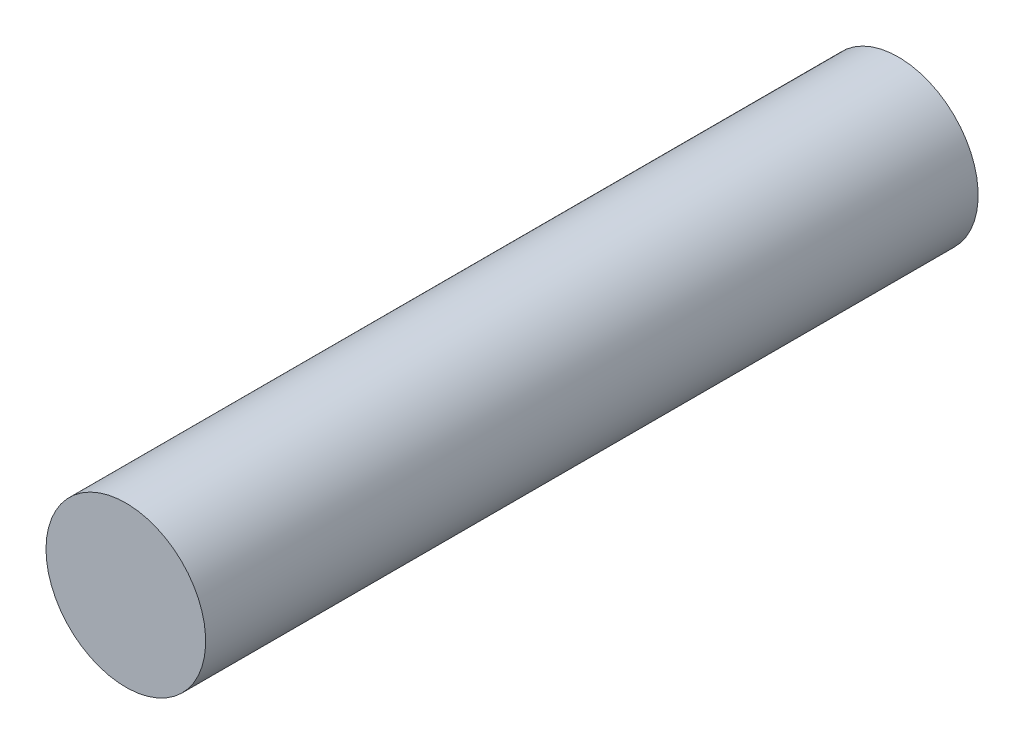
ISO-10303-21;
HEADER;
FILE_DESCRIPTION(('STEP AP214'),'2;1');
FILE_NAME('part.step','',(''),(''),'','','');
FILE_SCHEMA(('AUTOMOTIVE_DESIGN { 1 0 10303 214 1 1 1 1 }'));
ENDSEC;
DATA;
#1=APPLICATION_CONTEXT('core data for automotive mechanical design processes');
#2=APPLICATION_PROTOCOL_DEFINITION('international standard','automotive_design',2000,#1);
#3=PRODUCT_CONTEXT('',#1,'mechanical');
#4=PRODUCT('Part','Part','',(#3));
#5=PRODUCT_RELATED_PRODUCT_CATEGORY('part','',(#4));
#6=PRODUCT_DEFINITION_FORMATION('','',#4);
#7=PRODUCT_DEFINITION_CONTEXT('part definition',#1,'design');
#8=PRODUCT_DEFINITION('design','',#6,#7);
#9=PRODUCT_DEFINITION_SHAPE('','',#8);
#10=(LENGTH_UNIT() NAMED_UNIT(*) SI_UNIT(.MILLI.,.METRE.));
#11=(NAMED_UNIT(*) PLANE_ANGLE_UNIT() SI_UNIT($,.RADIAN.));
#12=(NAMED_UNIT(*) SI_UNIT($,.STERADIAN.) SOLID_ANGLE_UNIT());
#13=UNCERTAINTY_MEASURE_WITH_UNIT(LENGTH_MEASURE(1.E-05),#10,'distance_accuracy_value','');
#14=(GEOMETRIC_REPRESENTATION_CONTEXT(3) GLOBAL_UNCERTAINTY_ASSIGNED_CONTEXT((#13)) GLOBAL_UNIT_ASSIGNED_CONTEXT((#10,
#11,#12)) REPRESENTATION_CONTEXT('',''));
#15=CARTESIAN_POINT('',(0.,0.,0.));
#16=DIRECTION('',(0.,0.,1.));
#17=DIRECTION('',(1.,0.,0.));
#18=AXIS2_PLACEMENT_3D('',#15,#16,#17);
#19=CARTESIAN_POINT('',(0.,0.,38.1));
#20=DIRECTION('',(0.,0.,-1.));
#21=DIRECTION('',(-1.,0.,0.));
#22=AXIS2_PLACEMENT_3D('',#19,#20,#21);
#23=CYLINDRICAL_SURFACE('',#22,3.937);
#24=CARTESIAN_POINT('',(0.,0.,38.1));
#25=DIRECTION('',(0.,0.,1.));
#26=DIRECTION('',(1.,0.,0.));
#27=AXIS2_PLACEMENT_3D('',#24,#25,#26);
#28=CIRCLE('',#27,3.937);
#29=CARTESIAN_POINT('',(-3.937,0.,38.1));
#30=VERTEX_POINT('',#29);
#31=EDGE_CURVE('E10',#30,#30,#28,.T.);
#32=CARTESIAN_POINT('',(0.,0.,0.));
#33=DIRECTION('',(0.,0.,1.));
#34=DIRECTION('',(1.,0.,0.));
#35=AXIS2_PLACEMENT_3D('',#32,#33,#34);
#36=CIRCLE('',#35,3.937);
#37=CARTESIAN_POINT('',(-3.937,0.,0.));
#38=VERTEX_POINT('',#37);
#39=EDGE_CURVE('E46',#38,#38,#36,.T.);
#40=CARTESIAN_POINT('',(-3.937,0.,38.1));
#41=CARTESIAN_POINT('',(-3.937,0.,37.703125));
#42=CARTESIAN_POINT('',(-3.937,0.,37.30625));
#43=CARTESIAN_POINT('',(-3.937,0.,36.5125));
#44=CARTESIAN_POINT('',(-3.937,0.,36.115625));
#45=CARTESIAN_POINT('',(-3.937,0.,35.321875));
#46=CARTESIAN_POINT('',(-3.937,0.,34.925));
#47=CARTESIAN_POINT('',(-3.937,0.,34.13125));
#48=CARTESIAN_POINT('',(-3.937,0.,33.734375));
#49=CARTESIAN_POINT('',(-3.937,0.,32.940625));
#50=CARTESIAN_POINT('',(-3.937,0.,32.54375));
#51=CARTESIAN_POINT('',(-3.937,0.,31.75));
#52=CARTESIAN_POINT('',(-3.937,0.,31.353125));
#53=CARTESIAN_POINT('',(-3.937,0.,30.559375));
#54=CARTESIAN_POINT('',(-3.937,0.,30.1625));
#55=CARTESIAN_POINT('',(-3.937,0.,29.36875));
#56=CARTESIAN_POINT('',(-3.937,0.,28.971875));
#57=CARTESIAN_POINT('',(-3.937,0.,28.178125));
#58=CARTESIAN_POINT('',(-3.937,0.,27.78125));
#59=CARTESIAN_POINT('',(-3.937,0.,26.9875));
#60=CARTESIAN_POINT('',(-3.937,0.,26.590625));
#61=CARTESIAN_POINT('',(-3.937,0.,25.796875));
#62=CARTESIAN_POINT('',(-3.937,0.,25.4));
#63=CARTESIAN_POINT('',(-3.937,0.,24.60625));
#64=CARTESIAN_POINT('',(-3.937,0.,24.209375));
#65=CARTESIAN_POINT('',(-3.937,0.,23.415625));
#66=CARTESIAN_POINT('',(-3.937,0.,23.01875));
#67=CARTESIAN_POINT('',(-3.937,0.,22.225));
#68=CARTESIAN_POINT('',(-3.937,0.,21.828125));
#69=CARTESIAN_POINT('',(-3.937,0.,21.034375));
#70=CARTESIAN_POINT('',(-3.937,0.,20.6375));
#71=CARTESIAN_POINT('',(-3.937,0.,19.84375));
#72=CARTESIAN_POINT('',(-3.937,0.,19.446875));
#73=CARTESIAN_POINT('',(-3.937,0.,18.653125));
#74=CARTESIAN_POINT('',(-3.937,0.,18.25625));
#75=CARTESIAN_POINT('',(-3.937,0.,17.4625));
#76=CARTESIAN_POINT('',(-3.937,0.,17.065625));
#77=CARTESIAN_POINT('',(-3.937,0.,16.271875));
#78=CARTESIAN_POINT('',(-3.937,0.,15.875));
#79=CARTESIAN_POINT('',(-3.937,0.,15.08125));
#80=CARTESIAN_POINT('',(-3.937,0.,14.684375));
#81=CARTESIAN_POINT('',(-3.937,0.,13.890625));
#82=CARTESIAN_POINT('',(-3.937,0.,13.49375));
#83=CARTESIAN_POINT('',(-3.937,0.,12.7));
#84=CARTESIAN_POINT('',(-3.937,0.,12.303125));
#85=CARTESIAN_POINT('',(-3.937,0.,11.509375));
#86=CARTESIAN_POINT('',(-3.937,0.,11.1125));
#87=CARTESIAN_POINT('',(-3.937,0.,10.31875));
#88=CARTESIAN_POINT('',(-3.937,0.,9.92187499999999));
#89=CARTESIAN_POINT('',(-3.937,0.,9.128125));
#90=CARTESIAN_POINT('',(-3.937,0.,8.73124999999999));
#91=CARTESIAN_POINT('',(-3.937,0.,7.93749999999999));
#92=CARTESIAN_POINT('',(-3.937,0.,7.54062499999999));
#93=CARTESIAN_POINT('',(-3.937,0.,6.746875));
#94=CARTESIAN_POINT('',(-3.937,0.,6.35));
#95=CARTESIAN_POINT('',(-3.937,0.,5.55625));
#96=CARTESIAN_POINT('',(-3.937,0.,5.159375));
#97=CARTESIAN_POINT('',(-3.937,0.,4.365625));
#98=CARTESIAN_POINT('',(-3.937,0.,3.96875));
#99=CARTESIAN_POINT('',(-3.937,0.,3.175));
#100=CARTESIAN_POINT('',(-3.937,0.,2.778125));
#101=CARTESIAN_POINT('',(-3.937,0.,1.984375));
#102=CARTESIAN_POINT('',(-3.937,0.,1.5875));
#103=CARTESIAN_POINT('',(-3.937,0.,0.79375));
#104=CARTESIAN_POINT('',(-3.937,0.,0.396875));
#105=CARTESIAN_POINT('',(-3.937,0.,0.));
#106=B_SPLINE_CURVE_WITH_KNOTS('',3,(#40,#41,#42,#43,#44,#45,#46,#47,#48,#49,#50,#51,#52,#53,
#54,#55,#56,#57,#58,#59,#60,#61,#62,#63,#64,#65,#66,#67,#68,#69,#70,#71,#72,#73,#74,#75,#76,#77,
#78,#79,#80,#81,#82,#83,#84,#85,#86,#87,#88,#89,#90,#91,#92,#93,#94,#95,#96,#97,#98,#99,#100,
#101,#102,#103,#104,#105),.UNSPECIFIED.,.F.,.F.,(4,2,2,2,2,2,2,2,2,2,2,2,2,2,2,2,2,2,2,2,2,2,2,
2,2,2,2,2,2,2,2,2,4),(0.,1.190625,2.38125,3.571875,4.7625,5.953125,7.14375,8.334375,
9.52500000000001,10.715625,11.90625,13.096875,14.2875,15.478125,16.66875,17.859375,19.05,
20.240625,21.43125,22.621875,23.8125,25.003125,26.19375,27.384375,28.575,29.765625,30.95625,
32.146875,33.3375,34.528125,35.71875,36.909375,38.1),.UNSPECIFIED.);
#107=EDGE_CURVE('BSEAM43',#30,#38,#106,.T.);
#108=ORIENTED_EDGE('',*,*,#31,.F.);
#109=ORIENTED_EDGE('',*,*,#39,.T.);
#110=ORIENTED_EDGE('',*,*,#107,.T.);
#111=ORIENTED_EDGE('',*,*,#107,.F.);
#112=EDGE_LOOP('',(#108,#110,#109,#111));
#113=FACE_BOUND('',#112,.T.);
#114=ADVANCED_FACE('F43',(#113),#23,.T.);
#115=CARTESIAN_POINT('',(0.,0.,38.1));
#116=DIRECTION('',(0.,0.,1.));
#117=DIRECTION('',(1.,0.,0.));
#118=AXIS2_PLACEMENT_3D('',#115,#116,#117);
#119=PLANE('',#118);
#120=ORIENTED_EDGE('',*,*,#31,.T.);
#121=EDGE_LOOP('',(#120));
#122=FACE_BOUND('',#121,.T.);
#123=ADVANCED_FACE('F60',(#122),#119,.T.);
#124=CARTESIAN_POINT('',(0.,0.,0.));
#125=DIRECTION('',(0.,0.,1.));
#126=DIRECTION('',(1.,0.,0.));
#127=AXIS2_PLACEMENT_3D('',#124,#125,#126);
#128=PLANE('',#127);
#129=ORIENTED_EDGE('',*,*,#39,.F.);
#130=EDGE_LOOP('',(#129));
#131=FACE_BOUND('',#130,.T.);
#132=ADVANCED_FACE('F58',(#131),#128,.F.);
#133=CLOSED_SHELL('',(#114,#123,#132));
#134=MANIFOLD_SOLID_BREP('B2',#133);
#135=ADVANCED_BREP_SHAPE_REPRESENTATION('',(#18,#134),#14);
#136=SHAPE_DEFINITION_REPRESENTATION(#9,#135);
ENDSEC;
END-ISO-10303-21;
